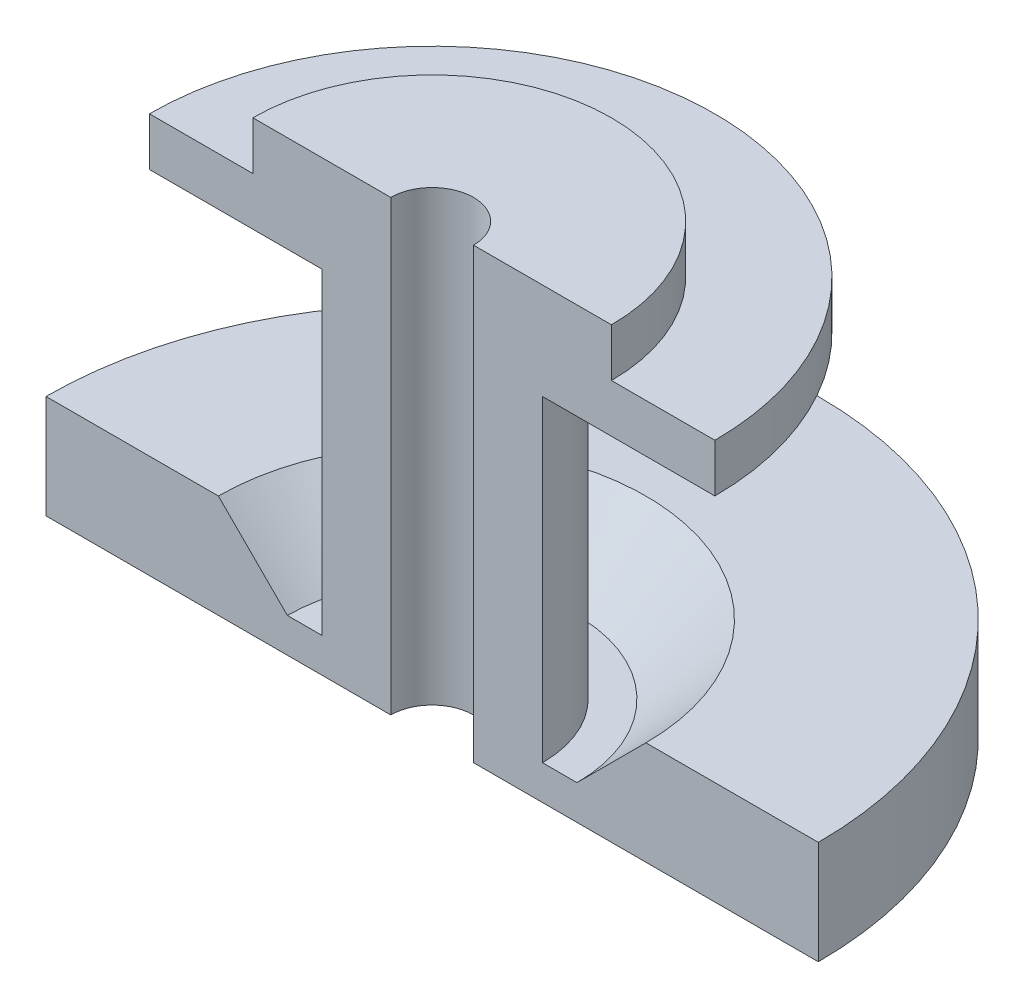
from build123d import *

# Parameters (mm, degrees)
REVOLVE1_ANGLE = 180


with BuildPart() as part:
    # Sketch1 → Revolve1 (revolve)
    with BuildSketch(Plane(origin=(0, 0, 0), x_dir=(-1, 0, 0), z_dir=(0, 0, 1))):
        Polygon((-26, 0), (-6, 0), (-6, 65), (-56, 65), (-56, 50), (-31, 50), (-21, 60), (-16, 60), (-16, 14), (-41, 14), (-41, 7), (-26, 7), align=None)
    revolve(axis=Axis((0, 0, 0), (0, 1, 0)), revolution_arc=REVOLVE1_ANGLE)


solid = part.part
